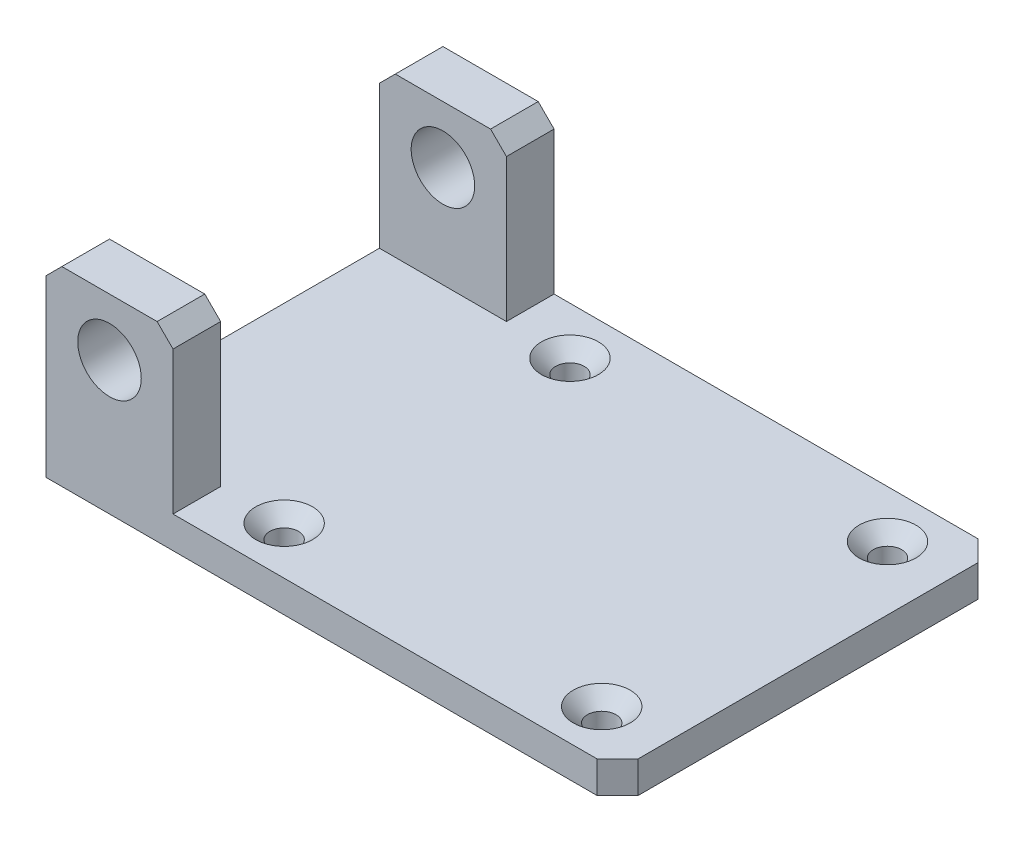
ISO-10303-21;
HEADER;
FILE_DESCRIPTION(('STEP AP214'),'2;1');
FILE_NAME('part.step','',(''),(''),'','','');
FILE_SCHEMA(('AUTOMOTIVE_DESIGN { 1 0 10303 214 1 1 1 1 }'));
ENDSEC;
DATA;
#1=APPLICATION_CONTEXT('core data for automotive mechanical design processes');
#2=APPLICATION_PROTOCOL_DEFINITION('international standard','automotive_design',2000,#1);
#3=PRODUCT_CONTEXT('',#1,'mechanical');
#4=PRODUCT('Part','Part','',(#3));
#5=PRODUCT_RELATED_PRODUCT_CATEGORY('part','',(#4));
#6=PRODUCT_DEFINITION_FORMATION('','',#4);
#7=PRODUCT_DEFINITION_CONTEXT('part definition',#1,'design');
#8=PRODUCT_DEFINITION('design','',#6,#7);
#9=PRODUCT_DEFINITION_SHAPE('','',#8);
#10=(LENGTH_UNIT() NAMED_UNIT(*) SI_UNIT(.MILLI.,.METRE.));
#11=(NAMED_UNIT(*) PLANE_ANGLE_UNIT() SI_UNIT($,.RADIAN.));
#12=(NAMED_UNIT(*) SI_UNIT($,.STERADIAN.) SOLID_ANGLE_UNIT());
#13=UNCERTAINTY_MEASURE_WITH_UNIT(LENGTH_MEASURE(1.E-05),#10,'distance_accuracy_value','');
#14=(GEOMETRIC_REPRESENTATION_CONTEXT(3) GLOBAL_UNCERTAINTY_ASSIGNED_CONTEXT((#13)) GLOBAL_UNIT_ASSIGNED_CONTEXT((#10,
#11,#12)) REPRESENTATION_CONTEXT('',''));
#15=CARTESIAN_POINT('',(0.,0.,0.));
#16=DIRECTION('',(0.,0.,1.));
#17=DIRECTION('',(1.,0.,0.));
#18=AXIS2_PLACEMENT_3D('',#15,#16,#17);
#19=CARTESIAN_POINT('',(0.,10.,0.));
#20=DIRECTION('',(0.,1.,0.));
#21=DIRECTION('',(0.,0.,1.));
#22=AXIS2_PLACEMENT_3D('',#19,#20,#21);
#23=PLANE('',#22);
#24=CARTESIAN_POINT('',(-30.,10.,45.));
#25=DIRECTION('',(0.,1.,0.));
#26=DIRECTION('',(0.,0.,1.));
#27=AXIS2_PLACEMENT_3D('',#24,#25,#26);
#28=CIRCLE('',#27,8.96);
#29=CARTESIAN_POINT('',(-30.,10.,53.96));
#30=VERTEX_POINT('',#29);
#31=EDGE_CURVE('E450',#30,#30,#28,.T.);
#32=ORIENTED_EDGE('',*,*,#31,.F.);
#33=EDGE_LOOP('',(#32));
#34=FACE_BOUND('',#33,.T.);
#35=CARTESIAN_POINT('',(70.,10.,45.));
#36=DIRECTION('',(0.,1.,0.));
#37=DIRECTION('',(0.,0.,1.));
#38=AXIS2_PLACEMENT_3D('',#35,#36,#37);
#39=CIRCLE('',#38,8.96);
#40=CARTESIAN_POINT('',(70.,10.,53.96));
#41=VERTEX_POINT('',#40);
#42=EDGE_CURVE('E441',#41,#41,#39,.T.);
#43=ORIENTED_EDGE('',*,*,#42,.F.);
#44=EDGE_LOOP('',(#43));
#45=FACE_BOUND('',#44,.T.);
#46=CARTESIAN_POINT('',(-30.,10.,-45.));
#47=DIRECTION('',(0.,1.,0.));
#48=DIRECTION('',(0.,0.,1.));
#49=AXIS2_PLACEMENT_3D('',#46,#47,#48);
#50=CIRCLE('',#49,8.96);
#51=CARTESIAN_POINT('',(-30.,10.,-36.04));
#52=VERTEX_POINT('',#51);
#53=EDGE_CURVE('E432',#52,#52,#50,.T.);
#54=ORIENTED_EDGE('',*,*,#53,.F.);
#55=EDGE_LOOP('',(#54));
#56=FACE_BOUND('',#55,.T.);
#57=CARTESIAN_POINT('',(70.,10.,-45.));
#58=DIRECTION('',(0.,1.,0.));
#59=DIRECTION('',(0.,0.,1.));
#60=AXIS2_PLACEMENT_3D('',#57,#58,#59);
#61=CIRCLE('',#60,8.96);
#62=CARTESIAN_POINT('',(70.,10.,-36.04));
#63=VERTEX_POINT('',#62);
#64=EDGE_CURVE('E423',#63,#63,#61,.T.);
#65=ORIENTED_EDGE('',*,*,#64,.F.);
#66=EDGE_LOOP('',(#65));
#67=FACE_BOUND('',#66,.T.);
#68=DIRECTION('',(0.,0.,-1.));
#69=VECTOR('',#68,1.);
#70=CARTESIAN_POINT('',(90.,10.,60.));
#71=LINE('',#70,#69);
#72=CARTESIAN_POINT('',(90.,10.,53.5));
#73=VERTEX_POINT('',#72);
#74=CARTESIAN_POINT('',(90.,10.,-53.5));
#75=VERTEX_POINT('',#74);
#76=EDGE_CURVE('E206',#73,#75,#71,.T.);
#77=ORIENTED_EDGE('',*,*,#76,.T.);
#78=DIRECTION('',(0.707106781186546,0.,0.707106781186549));
#79=VECTOR('',#78,1.);
#80=CARTESIAN_POINT('',(71.7500000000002,10.,-71.7499999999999));
#81=LINE('',#80,#79);
#82=CARTESIAN_POINT('',(83.5,10.,-60.));
#83=VERTEX_POINT('',#82);
#84=EDGE_CURVE('E55',#75,#83,#81,.F.);
#85=ORIENTED_EDGE('',*,*,#84,.T.);
#86=DIRECTION('',(-1.,0.,0.));
#87=VECTOR('',#86,1.);
#88=CARTESIAN_POINT('',(90.,10.,-60.));
#89=LINE('',#88,#87);
#90=CARTESIAN_POINT('',(-49.9999999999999,10.,-60.));
#91=VERTEX_POINT('',#90);
#92=EDGE_CURVE('E208',#83,#91,#89,.T.);
#93=ORIENTED_EDGE('',*,*,#92,.T.);
#94=DIRECTION('',(0.,0.,-1.));
#95=VECTOR('',#94,1.);
#96=CARTESIAN_POINT('',(-50.,10.,-45.));
#97=LINE('',#96,#95);
#98=CARTESIAN_POINT('',(-50.,10.,-45.));
#99=VERTEX_POINT('',#98);
#100=EDGE_CURVE('E394',#99,#91,#97,.T.);
#101=ORIENTED_EDGE('',*,*,#100,.F.);
#102=DIRECTION('',(1.,0.,0.));
#103=VECTOR('',#102,1.);
#104=CARTESIAN_POINT('',(-90.,10.,-45.));
#105=LINE('',#104,#103);
#106=CARTESIAN_POINT('',(-90.,10.,-45.));
#107=VERTEX_POINT('',#106);
#108=EDGE_CURVE('E169',#107,#99,#105,.T.);
#109=ORIENTED_EDGE('',*,*,#108,.F.);
#110=DIRECTION('',(0.,0.,1.));
#111=VECTOR('',#110,1.);
#112=CARTESIAN_POINT('',(-90.,10.,60.));
#113=LINE('',#112,#111);
#114=CARTESIAN_POINT('',(-90.,10.,45.));
#115=VERTEX_POINT('',#114);
#116=EDGE_CURVE('E163',#107,#115,#113,.T.);
#117=ORIENTED_EDGE('',*,*,#116,.T.);
#118=DIRECTION('',(1.,0.,0.));
#119=VECTOR('',#118,1.);
#120=CARTESIAN_POINT('',(-90.,10.,45.));
#121=LINE('',#120,#119);
#122=CARTESIAN_POINT('',(-50.,10.,45.));
#123=VERTEX_POINT('',#122);
#124=EDGE_CURVE('E167',#115,#123,#121,.T.);
#125=ORIENTED_EDGE('',*,*,#124,.T.);
#126=DIRECTION('',(0.,0.,1.));
#127=VECTOR('',#126,1.);
#128=CARTESIAN_POINT('',(-50.,10.,45.));
#129=LINE('',#128,#127);
#130=CARTESIAN_POINT('',(-49.9999999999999,10.,60.));
#131=VERTEX_POINT('',#130);
#132=EDGE_CURVE('E196',#123,#131,#129,.T.);
#133=ORIENTED_EDGE('',*,*,#132,.T.);
#134=DIRECTION('',(1.,0.,0.));
#135=VECTOR('',#134,1.);
#136=CARTESIAN_POINT('',(90.,10.,60.));
#137=LINE('',#136,#135);
#138=CARTESIAN_POINT('',(83.5,10.,60.));
#139=VERTEX_POINT('',#138);
#140=EDGE_CURVE('E172',#131,#139,#137,.T.);
#141=ORIENTED_EDGE('',*,*,#140,.T.);
#142=DIRECTION('',(-0.707106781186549,0.,0.707106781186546));
#143=VECTOR('',#142,1.);
#144=CARTESIAN_POINT('',(71.7499999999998,10.,71.7500000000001));
#145=LINE('',#144,#143);
#146=EDGE_CURVE('E268',#139,#73,#145,.F.);
#147=ORIENTED_EDGE('',*,*,#146,.T.);
#148=EDGE_LOOP('',(#77,#85,#93,#101,#109,#117,#125,#133,#141,#147));
#149=FACE_BOUND('',#148,.T.);
#150=ADVANCED_FACE('F47',(#34,#45,#56,#67,#149),#23,.T.);
#151=CARTESIAN_POINT('',(-90.,10.,60.));
#152=DIRECTION('',(1.,0.,0.));
#153=DIRECTION('',(0.,0.,-1.));
#154=AXIS2_PLACEMENT_3D('',#151,#152,#153);
#155=PLANE('',#154);
#156=DIRECTION('',(0.,-1.,0.));
#157=VECTOR('',#156,1.);
#158=CARTESIAN_POINT('',(-90.,10.,-45.));
#159=LINE('',#158,#157);
#160=CARTESIAN_POINT('',(-90.,55.,-45.));
#161=VERTEX_POINT('',#160);
#162=EDGE_CURVE('E399',#161,#107,#159,.T.);
#163=ORIENTED_EDGE('',*,*,#162,.F.);
#164=DIRECTION('',(0.,0.,-1.));
#165=VECTOR('',#164,1.);
#166=CARTESIAN_POINT('',(-90.,55.,60.));
#167=LINE('',#166,#165);
#168=CARTESIAN_POINT('',(-90.,55.,-60.));
#169=VERTEX_POINT('',#168);
#170=EDGE_CURVE('E239',#161,#169,#167,.T.);
#171=ORIENTED_EDGE('',*,*,#170,.T.);
#172=DIRECTION('',(0.,-1.,0.));
#173=VECTOR('',#172,1.);
#174=CARTESIAN_POINT('',(-90.,10.,-60.));
#175=LINE('',#174,#173);
#176=CARTESIAN_POINT('',(-90.,0.,-60.));
#177=VERTEX_POINT('',#176);
#178=EDGE_CURVE('E210',#169,#177,#175,.T.);
#179=ORIENTED_EDGE('',*,*,#178,.T.);
#180=DIRECTION('',(0.,0.,1.));
#181=VECTOR('',#180,1.);
#182=CARTESIAN_POINT('',(-90.,0.,60.));
#183=LINE('',#182,#181);
#184=CARTESIAN_POINT('',(-90.,0.,60.));
#185=VERTEX_POINT('',#184);
#186=EDGE_CURVE('E203',#177,#185,#183,.T.);
#187=ORIENTED_EDGE('',*,*,#186,.T.);
#188=DIRECTION('',(0.,-1.,0.));
#189=VECTOR('',#188,1.);
#190=CARTESIAN_POINT('',(-90.,10.,60.));
#191=LINE('',#190,#189);
#192=CARTESIAN_POINT('',(-90.,55.,60.));
#193=VERTEX_POINT('',#192);
#194=EDGE_CURVE('E220',#193,#185,#191,.T.);
#195=ORIENTED_EDGE('',*,*,#194,.F.);
#196=DIRECTION('',(0.,0.,-1.));
#197=VECTOR('',#196,1.);
#198=CARTESIAN_POINT('',(-90.,55.,45.));
#199=LINE('',#198,#197);
#200=CARTESIAN_POINT('',(-90.,55.,45.));
#201=VERTEX_POINT('',#200);
#202=EDGE_CURVE('E180',#193,#201,#199,.T.);
#203=ORIENTED_EDGE('',*,*,#202,.T.);
#204=DIRECTION('',(0.,-1.,0.));
#205=VECTOR('',#204,1.);
#206=CARTESIAN_POINT('',(-90.,10.,45.));
#207=LINE('',#206,#205);
#208=EDGE_CURVE('E176',#201,#115,#207,.T.);
#209=ORIENTED_EDGE('',*,*,#208,.T.);
#210=ORIENTED_EDGE('',*,*,#116,.F.);
#211=EDGE_LOOP('',(#163,#171,#179,#187,#195,#203,#209,#210));
#212=FACE_BOUND('',#211,.T.);
#213=ADVANCED_FACE('F177',(#212),#155,.F.);
#214=CARTESIAN_POINT('',(90.,10.,60.));
#215=DIRECTION('',(0.,0.,-1.));
#216=DIRECTION('',(-1.,0.,0.));
#217=AXIS2_PLACEMENT_3D('',#214,#215,#216);
#218=PLANE('',#217);
#219=DIRECTION('',(1.,0.,0.));
#220=VECTOR('',#219,1.);
#221=CARTESIAN_POINT('',(90.,0.,60.));
#222=LINE('',#221,#220);
#223=CARTESIAN_POINT('',(83.5,0.,60.));
#224=VERTEX_POINT('',#223);
#225=EDGE_CURVE('E213',#185,#224,#222,.T.);
#226=ORIENTED_EDGE('',*,*,#225,.T.);
#227=DIRECTION('',(0.,1.,0.));
#228=VECTOR('',#227,1.);
#229=CARTESIAN_POINT('',(83.5,10.,60.));
#230=LINE('',#229,#228);
#231=EDGE_CURVE('E13',#224,#139,#230,.T.);
#232=ORIENTED_EDGE('',*,*,#231,.T.);
#233=ORIENTED_EDGE('',*,*,#140,.F.);
#234=DIRECTION('',(0.,1.,0.));
#235=VECTOR('',#234,1.);
#236=CARTESIAN_POINT('',(-50.,10.,60.));
#237=LINE('',#236,#235);
#238=CARTESIAN_POINT('',(-50.,55.0000000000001,60.));
#239=VERTEX_POINT('',#238);
#240=EDGE_CURVE('E197',#131,#239,#237,.T.);
#241=ORIENTED_EDGE('',*,*,#240,.T.);
#242=DIRECTION('',(0.707106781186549,-0.707106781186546,0.));
#243=VECTOR('',#242,1.);
#244=CARTESIAN_POINT('',(-50.,55.0000000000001,60.));
#245=LINE('',#244,#243);
#246=CARTESIAN_POINT('',(-55.,60.,60.));
#247=VERTEX_POINT('',#246);
#248=EDGE_CURVE('E227',#239,#247,#245,.F.);
#249=ORIENTED_EDGE('',*,*,#248,.T.);
#250=DIRECTION('',(-1.,0.,0.));
#251=VECTOR('',#250,1.);
#252=CARTESIAN_POINT('',(-90.,60.,60.));
#253=LINE('',#252,#251);
#254=CARTESIAN_POINT('',(-85.,60.,60.));
#255=VERTEX_POINT('',#254);
#256=EDGE_CURVE('E183',#247,#255,#253,.T.);
#257=ORIENTED_EDGE('',*,*,#256,.T.);
#258=DIRECTION('',(-0.707106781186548,-0.707106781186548,0.));
#259=VECTOR('',#258,1.);
#260=CARTESIAN_POINT('',(-85.,60.,60.));
#261=LINE('',#260,#259);
#262=EDGE_CURVE('E229',#255,#193,#261,.T.);
#263=ORIENTED_EDGE('',*,*,#262,.T.);
#264=ORIENTED_EDGE('',*,*,#194,.T.);
#265=EDGE_LOOP('',(#226,#232,#233,#241,#249,#257,#263,#264));
#266=FACE_BOUND('',#265,.T.);
#267=CARTESIAN_POINT('',(-70.,42.,60.));
#268=DIRECTION('',(0.,0.,1.));
#269=DIRECTION('',(1.,0.,0.));
#270=AXIS2_PLACEMENT_3D('',#267,#268,#269);
#271=CIRCLE('',#270,10.);
#272=CARTESIAN_POINT('',(-60.,42.,60.));
#273=VERTEX_POINT('',#272);
#274=EDGE_CURVE('E393',#273,#273,#271,.T.);
#275=ORIENTED_EDGE('',*,*,#274,.F.);
#276=EDGE_LOOP('',(#275));
#277=FACE_BOUND('',#276,.T.);
#278=ADVANCED_FACE('F291',(#266,#277),#218,.F.);
#279=CARTESIAN_POINT('',(90.,10.,60.));
#280=DIRECTION('',(-1.,0.,0.));
#281=DIRECTION('',(0.,0.,1.));
#282=AXIS2_PLACEMENT_3D('',#279,#280,#281);
#283=PLANE('',#282);
#284=DIRECTION('',(0.,0.,-1.));
#285=VECTOR('',#284,1.);
#286=CARTESIAN_POINT('',(90.,0.,60.));
#287=LINE('',#286,#285);
#288=CARTESIAN_POINT('',(90.,0.,53.5));
#289=VERTEX_POINT('',#288);
#290=CARTESIAN_POINT('',(90.,0.,-53.5));
#291=VERTEX_POINT('',#290);
#292=EDGE_CURVE('E215',#289,#291,#287,.T.);
#293=ORIENTED_EDGE('',*,*,#292,.T.);
#294=DIRECTION('',(0.,1.,0.));
#295=VECTOR('',#294,1.);
#296=CARTESIAN_POINT('',(90.,10.,-53.5));
#297=LINE('',#296,#295);
#298=EDGE_CURVE('E68',#291,#75,#297,.T.);
#299=ORIENTED_EDGE('',*,*,#298,.T.);
#300=ORIENTED_EDGE('',*,*,#76,.F.);
#301=DIRECTION('',(0.,-1.,0.));
#302=VECTOR('',#301,1.);
#303=CARTESIAN_POINT('',(90.,10.,53.5));
#304=LINE('',#303,#302);
#305=EDGE_CURVE('E264',#73,#289,#304,.T.);
#306=ORIENTED_EDGE('',*,*,#305,.T.);
#307=EDGE_LOOP('',(#293,#299,#300,#306));
#308=FACE_BOUND('',#307,.T.);
#309=ADVANCED_FACE('F286',(#308),#283,.F.);
#310=CARTESIAN_POINT('',(90.,10.,-60.));
#311=DIRECTION('',(0.,0.,1.));
#312=DIRECTION('',(1.,0.,0.));
#313=AXIS2_PLACEMENT_3D('',#310,#311,#312);
#314=PLANE('',#313);
#315=ORIENTED_EDGE('',*,*,#92,.F.);
#316=DIRECTION('',(0.,-1.,0.));
#317=VECTOR('',#316,1.);
#318=CARTESIAN_POINT('',(83.5,10.,-60.));
#319=LINE('',#318,#317);
#320=CARTESIAN_POINT('',(83.5,0.,-60.));
#321=VERTEX_POINT('',#320);
#322=EDGE_CURVE('E257',#83,#321,#319,.T.);
#323=ORIENTED_EDGE('',*,*,#322,.T.);
#324=DIRECTION('',(-1.,0.,0.));
#325=VECTOR('',#324,1.);
#326=CARTESIAN_POINT('',(90.,0.,-60.));
#327=LINE('',#326,#325);
#328=EDGE_CURVE('E173',#321,#177,#327,.T.);
#329=ORIENTED_EDGE('',*,*,#328,.T.);
#330=ORIENTED_EDGE('',*,*,#178,.F.);
#331=DIRECTION('',(-0.707106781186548,-0.707106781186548,0.));
#332=VECTOR('',#331,1.);
#333=CARTESIAN_POINT('',(-90.,55.,-60.));
#334=LINE('',#333,#332);
#335=CARTESIAN_POINT('',(-85.,60.,-60.));
#336=VERTEX_POINT('',#335);
#337=EDGE_CURVE('E244',#169,#336,#334,.F.);
#338=ORIENTED_EDGE('',*,*,#337,.T.);
#339=DIRECTION('',(-1.,0.,0.));
#340=VECTOR('',#339,1.);
#341=CARTESIAN_POINT('',(-90.,60.,-60.));
#342=LINE('',#341,#340);
#343=CARTESIAN_POINT('',(-55.,60.,-60.));
#344=VERTEX_POINT('',#343);
#345=EDGE_CURVE('E400',#344,#336,#342,.T.);
#346=ORIENTED_EDGE('',*,*,#345,.F.);
#347=DIRECTION('',(-0.707106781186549,0.707106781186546,0.));
#348=VECTOR('',#347,1.);
#349=CARTESIAN_POINT('',(-55.,60.,-60.));
#350=LINE('',#349,#348);
#351=CARTESIAN_POINT('',(-50.,55.0000000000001,-60.));
#352=VERTEX_POINT('',#351);
#353=EDGE_CURVE('E242',#344,#352,#350,.F.);
#354=ORIENTED_EDGE('',*,*,#353,.T.);
#355=DIRECTION('',(0.,1.,0.));
#356=VECTOR('',#355,1.);
#357=CARTESIAN_POINT('',(-50.,10.,-60.));
#358=LINE('',#357,#356);
#359=EDGE_CURVE('E280',#91,#352,#358,.T.);
#360=ORIENTED_EDGE('',*,*,#359,.F.);
#361=EDGE_LOOP('',(#315,#323,#329,#330,#338,#346,#354,#360));
#362=FACE_BOUND('',#361,.T.);
#363=CARTESIAN_POINT('',(-70.,42.,-60.));
#364=DIRECTION('',(0.,0.,1.));
#365=DIRECTION('',(1.,0.,0.));
#366=AXIS2_PLACEMENT_3D('',#363,#364,#365);
#367=CIRCLE('',#366,10.);
#368=CARTESIAN_POINT('',(-60.,42.,-60.));
#369=VERTEX_POINT('',#368);
#370=EDGE_CURVE('E412',#369,#369,#367,.T.);
#371=ORIENTED_EDGE('',*,*,#370,.T.);
#372=EDGE_LOOP('',(#371));
#373=FACE_BOUND('',#372,.T.);
#374=ADVANCED_FACE('F276',(#362,#373),#314,.F.);
#375=CARTESIAN_POINT('',(0.,0.,0.));
#376=DIRECTION('',(0.,1.,0.));
#377=DIRECTION('',(0.,0.,1.));
#378=AXIS2_PLACEMENT_3D('',#375,#376,#377);
#379=PLANE('',#378);
#380=CARTESIAN_POINT('',(-30.,0.,45.));
#381=DIRECTION('',(0.,1.,0.));
#382=DIRECTION('',(0.,0.,1.));
#383=AXIS2_PLACEMENT_3D('',#380,#381,#382);
#384=CIRCLE('',#383,4.5);
#385=CARTESIAN_POINT('',(-30.,0.,49.5));
#386=VERTEX_POINT('',#385);
#387=EDGE_CURVE('E444',#386,#386,#384,.T.);
#388=ORIENTED_EDGE('',*,*,#387,.T.);
#389=EDGE_LOOP('',(#388));
#390=FACE_BOUND('',#389,.T.);
#391=CARTESIAN_POINT('',(70.,0.,45.));
#392=DIRECTION('',(0.,1.,0.));
#393=DIRECTION('',(0.,0.,1.));
#394=AXIS2_PLACEMENT_3D('',#391,#392,#393);
#395=CIRCLE('',#394,4.5);
#396=CARTESIAN_POINT('',(70.,0.,49.5));
#397=VERTEX_POINT('',#396);
#398=EDGE_CURVE('E435',#397,#397,#395,.T.);
#399=ORIENTED_EDGE('',*,*,#398,.T.);
#400=EDGE_LOOP('',(#399));
#401=FACE_BOUND('',#400,.T.);
#402=CARTESIAN_POINT('',(-30.,0.,-45.));
#403=DIRECTION('',(0.,1.,0.));
#404=DIRECTION('',(0.,0.,1.));
#405=AXIS2_PLACEMENT_3D('',#402,#403,#404);
#406=CIRCLE('',#405,4.5);
#407=CARTESIAN_POINT('',(-30.,0.,-40.5));
#408=VERTEX_POINT('',#407);
#409=EDGE_CURVE('E426',#408,#408,#406,.T.);
#410=ORIENTED_EDGE('',*,*,#409,.T.);
#411=EDGE_LOOP('',(#410));
#412=FACE_BOUND('',#411,.T.);
#413=CARTESIAN_POINT('',(70.,0.,-45.));
#414=DIRECTION('',(0.,1.,0.));
#415=DIRECTION('',(0.,0.,1.));
#416=AXIS2_PLACEMENT_3D('',#413,#414,#415);
#417=CIRCLE('',#416,4.5);
#418=CARTESIAN_POINT('',(70.,0.,-40.5));
#419=VERTEX_POINT('',#418);
#420=EDGE_CURVE('E415',#419,#419,#417,.T.);
#421=ORIENTED_EDGE('',*,*,#420,.T.);
#422=EDGE_LOOP('',(#421));
#423=FACE_BOUND('',#422,.T.);
#424=ORIENTED_EDGE('',*,*,#328,.F.);
#425=DIRECTION('',(-0.707106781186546,0.,-0.707106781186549));
#426=VECTOR('',#425,1.);
#427=CARTESIAN_POINT('',(83.5,0.,-60.));
#428=LINE('',#427,#426);
#429=EDGE_CURVE('E262',#321,#291,#428,.F.);
#430=ORIENTED_EDGE('',*,*,#429,.T.);
#431=ORIENTED_EDGE('',*,*,#292,.F.);
#432=DIRECTION('',(0.707106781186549,0.,-0.707106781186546));
#433=VECTOR('',#432,1.);
#434=CARTESIAN_POINT('',(90.,0.,53.5));
#435=LINE('',#434,#433);
#436=EDGE_CURVE('E260',#289,#224,#435,.F.);
#437=ORIENTED_EDGE('',*,*,#436,.T.);
#438=ORIENTED_EDGE('',*,*,#225,.F.);
#439=ORIENTED_EDGE('',*,*,#186,.F.);
#440=EDGE_LOOP('',(#424,#430,#431,#437,#438,#439));
#441=FACE_BOUND('',#440,.T.);
#442=ADVANCED_FACE('F284',(#390,#401,#412,#423,#441),#379,.F.);
#443=CARTESIAN_POINT('',(-90.,60.,45.));
#444=DIRECTION('',(0.,1.,0.));
#445=DIRECTION('',(-1.,0.,0.));
#446=AXIS2_PLACEMENT_3D('',#443,#444,#445);
#447=PLANE('',#446);
#448=DIRECTION('',(-1.,0.,0.));
#449=VECTOR('',#448,1.);
#450=CARTESIAN_POINT('',(-90.,60.,45.));
#451=LINE('',#450,#449);
#452=CARTESIAN_POINT('',(-55.,60.,45.));
#453=VERTEX_POINT('',#452);
#454=CARTESIAN_POINT('',(-85.,60.,45.));
#455=VERTEX_POINT('',#454);
#456=EDGE_CURVE('E190',#453,#455,#451,.T.);
#457=ORIENTED_EDGE('',*,*,#456,.T.);
#458=DIRECTION('',(0.,0.,1.));
#459=VECTOR('',#458,1.);
#460=CARTESIAN_POINT('',(-85.,60.,60.));
#461=LINE('',#460,#459);
#462=EDGE_CURVE('E224',#455,#255,#461,.T.);
#463=ORIENTED_EDGE('',*,*,#462,.T.);
#464=ORIENTED_EDGE('',*,*,#256,.F.);
#465=DIRECTION('',(0.,0.,-1.));
#466=VECTOR('',#465,1.);
#467=CARTESIAN_POINT('',(-55.,60.,45.));
#468=LINE('',#467,#466);
#469=EDGE_CURVE('E222',#247,#453,#468,.T.);
#470=ORIENTED_EDGE('',*,*,#469,.T.);
#471=EDGE_LOOP('',(#457,#463,#464,#470));
#472=FACE_BOUND('',#471,.T.);
#473=ADVANCED_FACE('F299',(#472),#447,.T.);
#474=CARTESIAN_POINT('',(-50.,10.,45.));
#475=DIRECTION('',(1.,0.,0.));
#476=DIRECTION('',(0.,1.,0.));
#477=AXIS2_PLACEMENT_3D('',#474,#475,#476);
#478=PLANE('',#477);
#479=DIRECTION('',(0.,1.,0.));
#480=VECTOR('',#479,1.);
#481=CARTESIAN_POINT('',(-50.,10.,45.));
#482=LINE('',#481,#480);
#483=CARTESIAN_POINT('',(-50.,55.0000000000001,45.));
#484=VERTEX_POINT('',#483);
#485=EDGE_CURVE('E188',#123,#484,#482,.T.);
#486=ORIENTED_EDGE('',*,*,#485,.T.);
#487=DIRECTION('',(0.,0.,1.));
#488=VECTOR('',#487,1.);
#489=CARTESIAN_POINT('',(-50.,55.0000000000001,45.));
#490=LINE('',#489,#488);
#491=EDGE_CURVE('E236',#484,#239,#490,.T.);
#492=ORIENTED_EDGE('',*,*,#491,.T.);
#493=ORIENTED_EDGE('',*,*,#240,.F.);
#494=ORIENTED_EDGE('',*,*,#132,.F.);
#495=EDGE_LOOP('',(#486,#492,#493,#494));
#496=FACE_BOUND('',#495,.T.);
#497=ADVANCED_FACE('F306',(#496),#478,.T.);
#498=CARTESIAN_POINT('',(0.,0.,45.));
#499=DIRECTION('',(0.,0.,-1.));
#500=DIRECTION('',(-1.,0.,0.));
#501=AXIS2_PLACEMENT_3D('',#498,#499,#500);
#502=PLANE('',#501);
#503=CARTESIAN_POINT('',(-70.,42.,45.));
#504=DIRECTION('',(0.,0.,1.));
#505=DIRECTION('',(1.,0.,0.));
#506=AXIS2_PLACEMENT_3D('',#503,#504,#505);
#507=CIRCLE('',#506,10.);
#508=CARTESIAN_POINT('',(-60.,42.,45.));
#509=VERTEX_POINT('',#508);
#510=EDGE_CURVE('E200',#509,#509,#507,.T.);
#511=ORIENTED_EDGE('',*,*,#510,.T.);
#512=EDGE_LOOP('',(#511));
#513=FACE_BOUND('',#512,.T.);
#514=ORIENTED_EDGE('',*,*,#208,.F.);
#515=DIRECTION('',(0.707106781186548,0.707106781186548,0.));
#516=VECTOR('',#515,1.);
#517=CARTESIAN_POINT('',(-72.5,72.5,45.));
#518=LINE('',#517,#516);
#519=EDGE_CURVE('E234',#201,#455,#518,.T.);
#520=ORIENTED_EDGE('',*,*,#519,.T.);
#521=ORIENTED_EDGE('',*,*,#456,.F.);
#522=DIRECTION('',(-0.707106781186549,0.707106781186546,0.));
#523=VECTOR('',#522,1.);
#524=CARTESIAN_POINT('',(2.50000000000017,2.50000000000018,45.));
#525=LINE('',#524,#523);
#526=EDGE_CURVE('E232',#453,#484,#525,.F.);
#527=ORIENTED_EDGE('',*,*,#526,.T.);
#528=ORIENTED_EDGE('',*,*,#485,.F.);
#529=ORIENTED_EDGE('',*,*,#124,.F.);
#530=EDGE_LOOP('',(#514,#520,#521,#527,#528,#529));
#531=FACE_BOUND('',#530,.T.);
#532=ADVANCED_FACE('F186',(#513,#531),#502,.T.);
#533=CARTESIAN_POINT('',(-70.,42.,45.));
#534=DIRECTION('',(0.,0.,1.));
#535=DIRECTION('',(1.,0.,0.));
#536=AXIS2_PLACEMENT_3D('',#533,#534,#535);
#537=CYLINDRICAL_SURFACE('',#536,10.);
#538=ORIENTED_EDGE('',*,*,#510,.F.);
#539=EDGE_LOOP('',(#538));
#540=FACE_BOUND('',#539,.T.);
#541=ORIENTED_EDGE('',*,*,#274,.T.);
#542=EDGE_LOOP('',(#541));
#543=FACE_BOUND('',#542,.T.);
#544=ADVANCED_FACE('F313',(#540,#543),#537,.F.);
#545=CARTESIAN_POINT('',(-85.,60.,45.));
#546=DIRECTION('',(-0.707106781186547,0.707106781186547,0.));
#547=DIRECTION('',(0.,0.,-1.));
#548=AXIS2_PLACEMENT_3D('',#545,#546,#547);
#549=PLANE('',#548);
#550=ORIENTED_EDGE('',*,*,#519,.F.);
#551=ORIENTED_EDGE('',*,*,#202,.F.);
#552=ORIENTED_EDGE('',*,*,#262,.F.);
#553=ORIENTED_EDGE('',*,*,#462,.F.);
#554=EDGE_LOOP('',(#550,#551,#552,#553));
#555=FACE_BOUND('',#554,.T.);
#556=ADVANCED_FACE('F294',(#555),#549,.T.);
#557=CARTESIAN_POINT('',(-50.,55.0000000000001,45.));
#558=DIRECTION('',(-0.707106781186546,-0.707106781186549,0.));
#559=DIRECTION('',(0.,0.,1.));
#560=AXIS2_PLACEMENT_3D('',#557,#558,#559);
#561=PLANE('',#560);
#562=ORIENTED_EDGE('',*,*,#526,.F.);
#563=ORIENTED_EDGE('',*,*,#469,.F.);
#564=ORIENTED_EDGE('',*,*,#248,.F.);
#565=ORIENTED_EDGE('',*,*,#491,.F.);
#566=EDGE_LOOP('',(#562,#563,#564,#565));
#567=FACE_BOUND('',#566,.T.);
#568=ADVANCED_FACE('F303',(#567),#561,.F.);
#569=CARTESIAN_POINT('',(0.,0.,-45.));
#570=DIRECTION('',(0.,0.,1.));
#571=DIRECTION('',(-1.,0.,0.));
#572=AXIS2_PLACEMENT_3D('',#569,#570,#571);
#573=PLANE('',#572);
#574=DIRECTION('',(-1.,0.,0.));
#575=VECTOR('',#574,1.);
#576=CARTESIAN_POINT('',(-90.,60.,-45.));
#577=LINE('',#576,#575);
#578=CARTESIAN_POINT('',(-55.,60.,-45.));
#579=VERTEX_POINT('',#578);
#580=CARTESIAN_POINT('',(-85.,60.,-45.));
#581=VERTEX_POINT('',#580);
#582=EDGE_CURVE('E408',#579,#581,#577,.T.);
#583=ORIENTED_EDGE('',*,*,#582,.T.);
#584=DIRECTION('',(0.707106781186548,0.707106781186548,0.));
#585=VECTOR('',#584,1.);
#586=CARTESIAN_POINT('',(-72.5,72.5,-45.));
#587=LINE('',#586,#585);
#588=EDGE_CURVE('E253',#581,#161,#587,.F.);
#589=ORIENTED_EDGE('',*,*,#588,.T.);
#590=ORIENTED_EDGE('',*,*,#162,.T.);
#591=ORIENTED_EDGE('',*,*,#108,.T.);
#592=DIRECTION('',(0.,1.,0.));
#593=VECTOR('',#592,1.);
#594=CARTESIAN_POINT('',(-50.,10.,-45.));
#595=LINE('',#594,#593);
#596=CARTESIAN_POINT('',(-50.,55.0000000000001,-45.));
#597=VERTEX_POINT('',#596);
#598=EDGE_CURVE('E405',#99,#597,#595,.T.);
#599=ORIENTED_EDGE('',*,*,#598,.T.);
#600=DIRECTION('',(0.707106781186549,-0.707106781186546,0.));
#601=VECTOR('',#600,1.);
#602=CARTESIAN_POINT('',(2.50000000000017,2.50000000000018,-45.));
#603=LINE('',#602,#601);
#604=EDGE_CURVE('E251',#597,#579,#603,.F.);
#605=ORIENTED_EDGE('',*,*,#604,.T.);
#606=EDGE_LOOP('',(#583,#589,#590,#591,#599,#605));
#607=FACE_BOUND('',#606,.T.);
#608=CARTESIAN_POINT('',(-70.,42.,-45.));
#609=DIRECTION('',(0.,0.,1.));
#610=DIRECTION('',(1.,0.,0.));
#611=AXIS2_PLACEMENT_3D('',#608,#609,#610);
#612=CIRCLE('',#611,10.);
#613=CARTESIAN_POINT('',(-60.,42.,-45.));
#614=VERTEX_POINT('',#613);
#615=EDGE_CURVE('E403',#614,#614,#612,.T.);
#616=ORIENTED_EDGE('',*,*,#615,.F.);
#617=EDGE_LOOP('',(#616));
#618=FACE_BOUND('',#617,.T.);
#619=ADVANCED_FACE('F340',(#607,#618),#573,.T.);
#620=CARTESIAN_POINT('',(-50.,10.,-45.));
#621=DIRECTION('',(-1.,0.,0.));
#622=DIRECTION('',(0.,-1.,0.));
#623=AXIS2_PLACEMENT_3D('',#620,#621,#622);
#624=PLANE('',#623);
#625=ORIENTED_EDGE('',*,*,#359,.T.);
#626=DIRECTION('',(0.,0.,1.));
#627=VECTOR('',#626,1.);
#628=CARTESIAN_POINT('',(-50.,55.0000000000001,-45.));
#629=LINE('',#628,#627);
#630=EDGE_CURVE('E255',#352,#597,#629,.T.);
#631=ORIENTED_EDGE('',*,*,#630,.T.);
#632=ORIENTED_EDGE('',*,*,#598,.F.);
#633=ORIENTED_EDGE('',*,*,#100,.T.);
#634=EDGE_LOOP('',(#625,#631,#632,#633));
#635=FACE_BOUND('',#634,.T.);
#636=ADVANCED_FACE('F376',(#635),#624,.F.);
#637=CARTESIAN_POINT('',(-90.,60.,-45.));
#638=DIRECTION('',(0.,-1.,0.));
#639=DIRECTION('',(1.,0.,0.));
#640=AXIS2_PLACEMENT_3D('',#637,#638,#639);
#641=PLANE('',#640);
#642=ORIENTED_EDGE('',*,*,#345,.T.);
#643=DIRECTION('',(0.,0.,1.));
#644=VECTOR('',#643,1.);
#645=CARTESIAN_POINT('',(-85.,60.,-45.));
#646=LINE('',#645,#644);
#647=EDGE_CURVE('E249',#336,#581,#646,.T.);
#648=ORIENTED_EDGE('',*,*,#647,.T.);
#649=ORIENTED_EDGE('',*,*,#582,.F.);
#650=DIRECTION('',(0.,0.,-1.));
#651=VECTOR('',#650,1.);
#652=CARTESIAN_POINT('',(-55.,60.,-45.));
#653=LINE('',#652,#651);
#654=EDGE_CURVE('E246',#579,#344,#653,.T.);
#655=ORIENTED_EDGE('',*,*,#654,.T.);
#656=EDGE_LOOP('',(#642,#648,#649,#655));
#657=FACE_BOUND('',#656,.T.);
#658=ADVANCED_FACE('F372',(#657),#641,.F.);
#659=CARTESIAN_POINT('',(-70.,42.,-45.));
#660=DIRECTION('',(0.,0.,-1.));
#661=DIRECTION('',(-1.,0.,0.));
#662=AXIS2_PLACEMENT_3D('',#659,#660,#661);
#663=CYLINDRICAL_SURFACE('',#662,10.);
#664=ORIENTED_EDGE('',*,*,#615,.T.);
#665=EDGE_LOOP('',(#664));
#666=FACE_BOUND('',#665,.T.);
#667=ORIENTED_EDGE('',*,*,#370,.F.);
#668=EDGE_LOOP('',(#667));
#669=FACE_BOUND('',#668,.T.);
#670=ADVANCED_FACE('F345',(#666,#669),#663,.F.);
#671=CARTESIAN_POINT('',(-90.,55.,60.));
#672=DIRECTION('',(0.707106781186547,-0.707106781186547,0.));
#673=DIRECTION('',(0.,0.,-1.));
#674=AXIS2_PLACEMENT_3D('',#671,#672,#673);
#675=PLANE('',#674);
#676=ORIENTED_EDGE('',*,*,#588,.F.);
#677=ORIENTED_EDGE('',*,*,#647,.F.);
#678=ORIENTED_EDGE('',*,*,#337,.F.);
#679=ORIENTED_EDGE('',*,*,#170,.F.);
#680=EDGE_LOOP('',(#676,#677,#678,#679));
#681=FACE_BOUND('',#680,.T.);
#682=ADVANCED_FACE('F341',(#681),#675,.F.);
#683=CARTESIAN_POINT('',(-55.,60.,-45.));
#684=DIRECTION('',(-0.707106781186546,-0.707106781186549,0.));
#685=DIRECTION('',(0.,0.,-1.));
#686=AXIS2_PLACEMENT_3D('',#683,#684,#685);
#687=PLANE('',#686);
#688=ORIENTED_EDGE('',*,*,#604,.F.);
#689=ORIENTED_EDGE('',*,*,#630,.F.);
#690=ORIENTED_EDGE('',*,*,#353,.F.);
#691=ORIENTED_EDGE('',*,*,#654,.F.);
#692=EDGE_LOOP('',(#688,#689,#690,#691));
#693=FACE_BOUND('',#692,.T.);
#694=ADVANCED_FACE('F344',(#693),#687,.F.);
#695=CARTESIAN_POINT('',(83.5,10.,-60.));
#696=DIRECTION('',(-0.707106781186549,0.,0.707106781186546));
#697=DIRECTION('',(0.,-1.,0.));
#698=AXIS2_PLACEMENT_3D('',#695,#696,#697);
#699=PLANE('',#698);
#700=ORIENTED_EDGE('',*,*,#84,.F.);
#701=ORIENTED_EDGE('',*,*,#298,.F.);
#702=ORIENTED_EDGE('',*,*,#429,.F.);
#703=ORIENTED_EDGE('',*,*,#322,.F.);
#704=EDGE_LOOP('',(#700,#701,#702,#703));
#705=FACE_BOUND('',#704,.T.);
#706=ADVANCED_FACE('F281',(#705),#699,.F.);
#707=CARTESIAN_POINT('',(90.,10.,53.5));
#708=DIRECTION('',(-0.707106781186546,0.,-0.707106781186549));
#709=DIRECTION('',(0.,-1.,0.));
#710=AXIS2_PLACEMENT_3D('',#707,#708,#709);
#711=PLANE('',#710);
#712=ORIENTED_EDGE('',*,*,#146,.F.);
#713=ORIENTED_EDGE('',*,*,#231,.F.);
#714=ORIENTED_EDGE('',*,*,#436,.F.);
#715=ORIENTED_EDGE('',*,*,#305,.F.);
#716=EDGE_LOOP('',(#712,#713,#714,#715));
#717=FACE_BOUND('',#716,.T.);
#718=ADVANCED_FACE('F49',(#717),#711,.F.);
#719=CARTESIAN_POINT('',(70.,10.,-45.));
#720=DIRECTION('',(0.,1.,0.));
#721=DIRECTION('',(0.,0.,1.));
#722=AXIS2_PLACEMENT_3D('',#719,#720,#721);
#723=CYLINDRICAL_SURFACE('',#722,4.5);
#724=ORIENTED_EDGE('',*,*,#420,.F.);
#725=EDGE_LOOP('',(#724));
#726=FACE_BOUND('',#725,.T.);
#727=CARTESIAN_POINT('',(70.,5.54,-45.));
#728=DIRECTION('',(0.,1.,0.));
#729=DIRECTION('',(0.,0.,1.));
#730=AXIS2_PLACEMENT_3D('',#727,#728,#729);
#731=CIRCLE('',#730,4.5);
#732=CARTESIAN_POINT('',(70.,5.54,-40.5));
#733=VERTEX_POINT('',#732);
#734=EDGE_CURVE('E420',#733,#733,#731,.T.);
#735=ORIENTED_EDGE('',*,*,#734,.T.);
#736=EDGE_LOOP('',(#735));
#737=FACE_BOUND('',#736,.T.);
#738=ADVANCED_FACE('F353',(#726,#737),#723,.F.);
#739=CARTESIAN_POINT('',(70.,10.,-45.));
#740=DIRECTION('',(0.,1.,0.));
#741=DIRECTION('',(0.,0.,1.));
#742=AXIS2_PLACEMENT_3D('',#739,#740,#741);
#743=CONICAL_SURFACE('',#742,8.96,0.785398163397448);
#744=ORIENTED_EDGE('',*,*,#734,.F.);
#745=EDGE_LOOP('',(#744));
#746=FACE_BOUND('',#745,.T.);
#747=ORIENTED_EDGE('',*,*,#64,.T.);
#748=EDGE_LOOP('',(#747));
#749=FACE_BOUND('',#748,.T.);
#750=ADVANCED_FACE('F357',(#746,#749),#743,.F.);
#751=CARTESIAN_POINT('',(-30.,10.,-45.));
#752=DIRECTION('',(0.,1.,0.));
#753=DIRECTION('',(0.,0.,1.));
#754=AXIS2_PLACEMENT_3D('',#751,#752,#753);
#755=CYLINDRICAL_SURFACE('',#754,4.5);
#756=ORIENTED_EDGE('',*,*,#409,.F.);
#757=EDGE_LOOP('',(#756));
#758=FACE_BOUND('',#757,.T.);
#759=CARTESIAN_POINT('',(-30.,5.54,-45.));
#760=DIRECTION('',(0.,1.,0.));
#761=DIRECTION('',(0.,0.,1.));
#762=AXIS2_PLACEMENT_3D('',#759,#760,#761);
#763=CIRCLE('',#762,4.5);
#764=CARTESIAN_POINT('',(-30.,5.54,-40.5));
#765=VERTEX_POINT('',#764);
#766=EDGE_CURVE('E429',#765,#765,#763,.T.);
#767=ORIENTED_EDGE('',*,*,#766,.T.);
#768=EDGE_LOOP('',(#767));
#769=FACE_BOUND('',#768,.T.);
#770=ADVANCED_FACE('F363',(#758,#769),#755,.F.);
#771=CARTESIAN_POINT('',(-30.,10.,-45.));
#772=DIRECTION('',(0.,1.,0.));
#773=DIRECTION('',(0.,0.,1.));
#774=AXIS2_PLACEMENT_3D('',#771,#772,#773);
#775=CONICAL_SURFACE('',#774,8.96,0.785398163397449);
#776=ORIENTED_EDGE('',*,*,#766,.F.);
#777=EDGE_LOOP('',(#776));
#778=FACE_BOUND('',#777,.T.);
#779=ORIENTED_EDGE('',*,*,#53,.T.);
#780=EDGE_LOOP('',(#779));
#781=FACE_BOUND('',#780,.T.);
#782=ADVANCED_FACE('F472',(#778,#781),#775,.F.);
#783=CARTESIAN_POINT('',(70.,10.,45.));
#784=DIRECTION('',(0.,1.,0.));
#785=DIRECTION('',(0.,0.,1.));
#786=AXIS2_PLACEMENT_3D('',#783,#784,#785);
#787=CYLINDRICAL_SURFACE('',#786,4.5);
#788=ORIENTED_EDGE('',*,*,#398,.F.);
#789=EDGE_LOOP('',(#788));
#790=FACE_BOUND('',#789,.T.);
#791=CARTESIAN_POINT('',(70.,5.54,45.));
#792=DIRECTION('',(0.,1.,0.));
#793=DIRECTION('',(0.,0.,1.));
#794=AXIS2_PLACEMENT_3D('',#791,#792,#793);
#795=CIRCLE('',#794,4.5);
#796=CARTESIAN_POINT('',(70.,5.54,49.5));
#797=VERTEX_POINT('',#796);
#798=EDGE_CURVE('E438',#797,#797,#795,.T.);
#799=ORIENTED_EDGE('',*,*,#798,.T.);
#800=EDGE_LOOP('',(#799));
#801=FACE_BOUND('',#800,.T.);
#802=ADVANCED_FACE('F468',(#790,#801),#787,.F.);
#803=CARTESIAN_POINT('',(70.,10.,45.));
#804=DIRECTION('',(0.,1.,0.));
#805=DIRECTION('',(0.,0.,1.));
#806=AXIS2_PLACEMENT_3D('',#803,#804,#805);
#807=CONICAL_SURFACE('',#806,8.96,0.785398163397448);
#808=ORIENTED_EDGE('',*,*,#798,.F.);
#809=EDGE_LOOP('',(#808));
#810=FACE_BOUND('',#809,.T.);
#811=ORIENTED_EDGE('',*,*,#42,.T.);
#812=EDGE_LOOP('',(#811));
#813=FACE_BOUND('',#812,.T.);
#814=ADVANCED_FACE('F461',(#810,#813),#807,.F.);
#815=CARTESIAN_POINT('',(-30.,10.,45.));
#816=DIRECTION('',(0.,1.,0.));
#817=DIRECTION('',(0.,0.,1.));
#818=AXIS2_PLACEMENT_3D('',#815,#816,#817);
#819=CYLINDRICAL_SURFACE('',#818,4.5);
#820=ORIENTED_EDGE('',*,*,#387,.F.);
#821=EDGE_LOOP('',(#820));
#822=FACE_BOUND('',#821,.T.);
#823=CARTESIAN_POINT('',(-30.,5.54,45.));
#824=DIRECTION('',(0.,1.,0.));
#825=DIRECTION('',(0.,0.,1.));
#826=AXIS2_PLACEMENT_3D('',#823,#824,#825);
#827=CIRCLE('',#826,4.5);
#828=CARTESIAN_POINT('',(-30.,5.54,49.5));
#829=VERTEX_POINT('',#828);
#830=EDGE_CURVE('E447',#829,#829,#827,.T.);
#831=ORIENTED_EDGE('',*,*,#830,.T.);
#832=EDGE_LOOP('',(#831));
#833=FACE_BOUND('',#832,.T.);
#834=ADVANCED_FACE('F455',(#822,#833),#819,.F.);
#835=CARTESIAN_POINT('',(-30.,10.,45.));
#836=DIRECTION('',(0.,1.,0.));
#837=DIRECTION('',(0.,0.,1.));
#838=AXIS2_PLACEMENT_3D('',#835,#836,#837);
#839=CONICAL_SURFACE('',#838,8.96,0.785398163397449);
#840=ORIENTED_EDGE('',*,*,#830,.F.);
#841=EDGE_LOOP('',(#840));
#842=FACE_BOUND('',#841,.T.);
#843=ORIENTED_EDGE('',*,*,#31,.T.);
#844=EDGE_LOOP('',(#843));
#845=FACE_BOUND('',#844,.T.);
#846=ADVANCED_FACE('F453',(#842,#845),#839,.F.);
#847=CLOSED_SHELL('',(#150,#213,#278,#309,#374,#442,#473,#497,#532,#544,#556,#568,#619,#636,
#658,#670,#682,#694,#706,#718,#738,#750,#770,#782,#802,#814,#834,#846));
#848=MANIFOLD_SOLID_BREP('B2',#847);
#849=ADVANCED_BREP_SHAPE_REPRESENTATION('',(#18,#848),#14);
#850=SHAPE_DEFINITION_REPRESENTATION(#9,#849);
ENDSEC;
END-ISO-10303-21;
